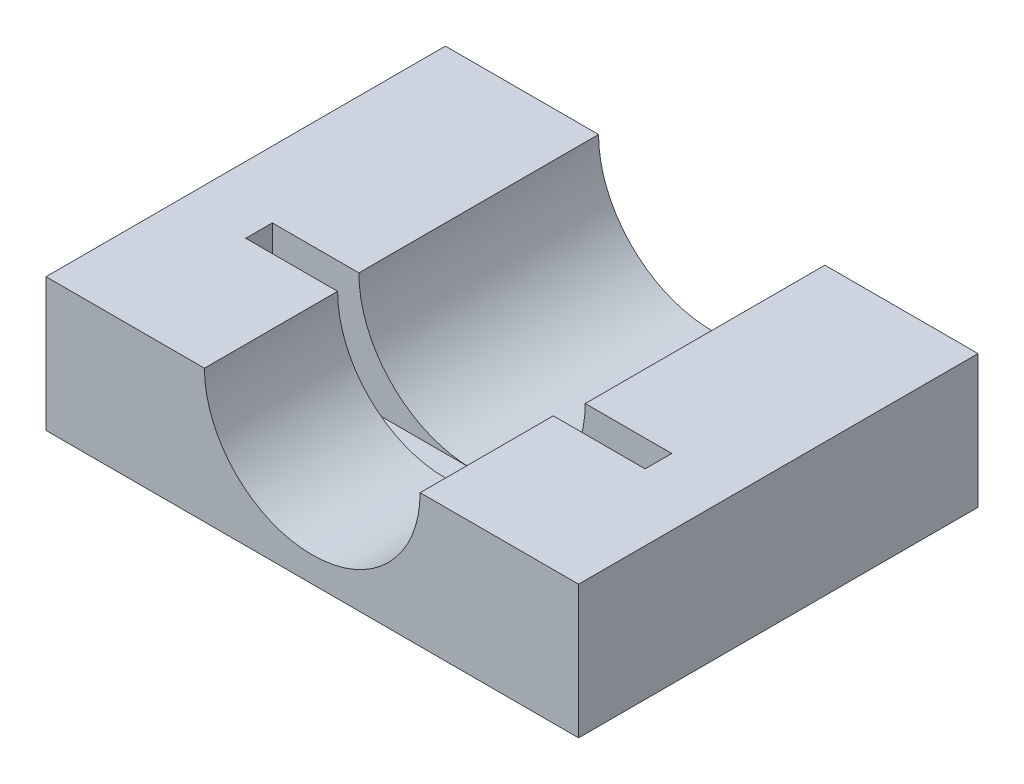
from build123d import *

# Parameters (mm, degrees)
SKETCH1_W           = 40
SKETCH1_H           = 10
BOSS_EXTRUDE1_DEPTH = 30
CUT_EXTRUDE1_DEPTH  = 18
SKETCH2_W           = 30
SKETCH2_H           = 2
CUT_EXTRUDE2_DEPTH  = 8.5
SKETCH3_R           = 8.098798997
CUT_EXTRUDE3_DEPTH  = 21.5


with BuildPart() as part:
    # Sketch1 → Boss-Extrude1 (new body)
    with BuildSketch(Plane.XY):
        with Locations((-20, 5)):
            Rectangle(SKETCH1_W, SKETCH1_H)
    extrude(amount=BOSS_EXTRUDE1_DEPTH)

    # Sketch1_4 → Cut-Extrude1 (cut)
    with BuildSketch(Plane.XY):
        with BuildLine():
            ThreePointArc((-28.5, 10), (-20, 1.5), (-11.5, 10))
            Line((-11.5, 10), (-28.5, 10))
        make_face()
        with BuildLine():
            Line((-28.5, 10), (-11.5, 10))
            ThreePointArc((-11.5, 10), (-20, 18.5), (-28.5, 10))
        make_face()
    extrude(amount=CUT_EXTRUDE1_DEPTH, mode=Mode.SUBTRACT)

    # Sketch2 → Cut-Extrude2 (cut)
    with BuildSketch(Plane(origin=(0, 10, 0), x_dir=(1, 0, 0), z_dir=(0, 1, 0))):
        with Locations((-20, -19)):
            Rectangle(SKETCH2_W, SKETCH2_H)
    extrude(amount=-CUT_EXTRUDE2_DEPTH, mode=Mode.SUBTRACT)

    # Sketch3 → Cut-Extrude3 (cut)
    with BuildSketch(Plane(origin=(0, 0, 20), x_dir=(-1, 0, 0), z_dir=(0, 0, -1))):
        with Locations((20, 10)):
            Circle(SKETCH3_R)
    extrude(amount=-CUT_EXTRUDE3_DEPTH, mode=Mode.SUBTRACT)


solid = part.part
